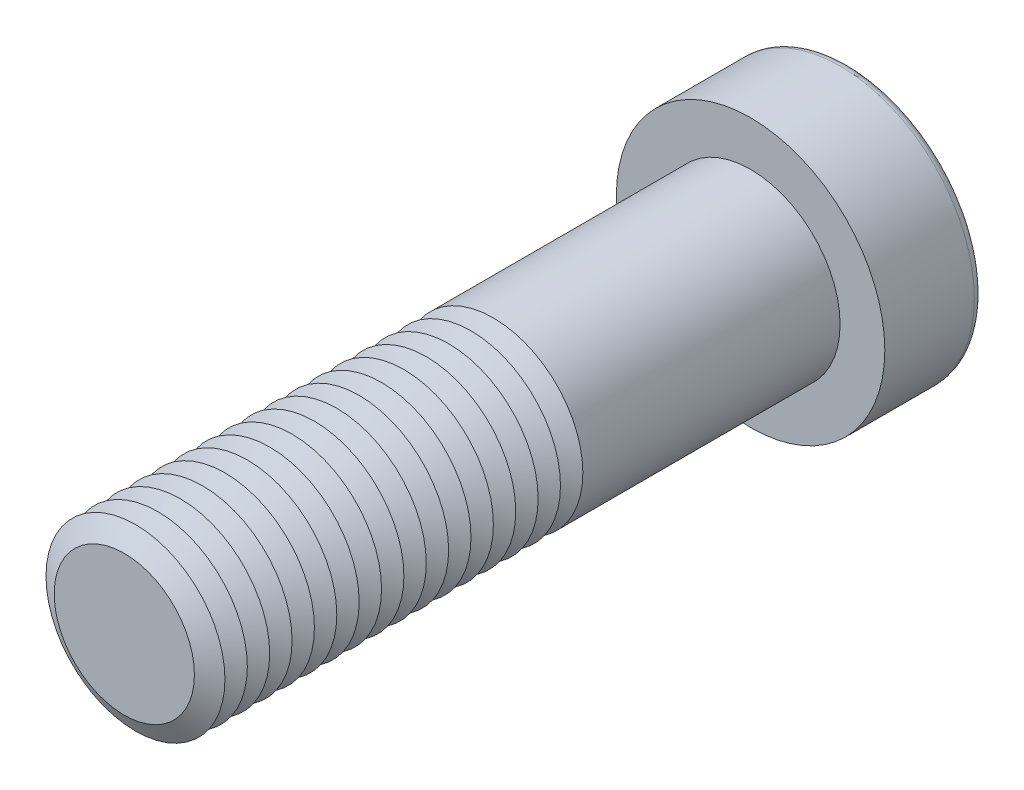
ISO-10303-21;
HEADER;
FILE_DESCRIPTION(('STEP AP214'),'2;1');
FILE_NAME('part.step','',(''),(''),'','','');
FILE_SCHEMA(('AUTOMOTIVE_DESIGN { 1 0 10303 214 1 1 1 1 }'));
ENDSEC;
DATA;
#1=APPLICATION_CONTEXT('core data for automotive mechanical design processes');
#2=APPLICATION_PROTOCOL_DEFINITION('international standard','automotive_design',2000,#1);
#3=PRODUCT_CONTEXT('',#1,'mechanical');
#4=PRODUCT('Part','Part','',(#3));
#5=PRODUCT_RELATED_PRODUCT_CATEGORY('part','',(#4));
#6=PRODUCT_DEFINITION_FORMATION('','',#4);
#7=PRODUCT_DEFINITION_CONTEXT('part definition',#1,'design');
#8=PRODUCT_DEFINITION('design','',#6,#7);
#9=PRODUCT_DEFINITION_SHAPE('','',#8);
#10=(LENGTH_UNIT() NAMED_UNIT(*) SI_UNIT(.MILLI.,.METRE.));
#11=(NAMED_UNIT(*) PLANE_ANGLE_UNIT() SI_UNIT($,.RADIAN.));
#12=(NAMED_UNIT(*) SI_UNIT($,.STERADIAN.) SOLID_ANGLE_UNIT());
#13=UNCERTAINTY_MEASURE_WITH_UNIT(LENGTH_MEASURE(1.E-05),#10,'distance_accuracy_value','');
#14=(GEOMETRIC_REPRESENTATION_CONTEXT(3) GLOBAL_UNCERTAINTY_ASSIGNED_CONTEXT((#13)) GLOBAL_UNIT_ASSIGNED_CONTEXT((#10,
#11,#12)) REPRESENTATION_CONTEXT('',''));
#15=CARTESIAN_POINT('',(0.,0.,0.));
#16=DIRECTION('',(0.,0.,1.));
#17=DIRECTION('',(1.,0.,0.));
#18=AXIS2_PLACEMENT_3D('',#15,#16,#17);
#19=CARTESIAN_POINT('',(0.,0.,61.25));
#20=DIRECTION('',(0.,0.,1.));
#21=DIRECTION('',(1.,0.,0.));
#22=AXIS2_PLACEMENT_3D('',#19,#20,#21);
#23=CONICAL_SURFACE('',#22,10.,1.0471975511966);
#24=CARTESIAN_POINT('',(0.,0.,60.));
#25=DIRECTION('',(0.,0.,1.));
#26=DIRECTION('',(1.,0.,0.));
#27=AXIS2_PLACEMENT_3D('',#24,#25,#26);
#28=CIRCLE('',#27,7.8349364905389);
#29=CARTESIAN_POINT('',(7.8349364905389,0.,60.));
#30=VERTEX_POINT('',#29);
#31=EDGE_CURVE('E313',#30,#30,#28,.T.);
#32=ORIENTED_EDGE('',*,*,#31,.T.);
#33=EDGE_LOOP('',(#32));
#34=FACE_BOUND('',#33,.T.);
#35=CARTESIAN_POINT('',(0.,0.,61.25));
#36=DIRECTION('',(0.,0.,1.));
#37=DIRECTION('',(1.,0.,0.));
#38=AXIS2_PLACEMENT_3D('',#35,#36,#37);
#39=CIRCLE('',#38,10.);
#40=CARTESIAN_POINT('',(10.,0.,61.25));
#41=VERTEX_POINT('',#40);
#42=EDGE_CURVE('E316',#41,#41,#39,.T.);
#43=ORIENTED_EDGE('',*,*,#42,.F.);
#44=EDGE_LOOP('',(#43));
#45=FACE_BOUND('',#44,.T.);
#46=ADVANCED_FACE('F39',(#34,#45),#23,.T.);
#47=CARTESIAN_POINT('',(0.,0.,60.));
#48=DIRECTION('',(0.,0.,-1.));
#49=DIRECTION('',(-1.,0.,0.));
#50=AXIS2_PLACEMENT_3D('',#47,#48,#49);
#51=CONICAL_SURFACE('',#50,7.8349364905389,1.0471975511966);
#52=CARTESIAN_POINT('',(0.,0.,58.75));
#53=DIRECTION('',(0.,0.,1.));
#54=DIRECTION('',(1.,0.,0.));
#55=AXIS2_PLACEMENT_3D('',#52,#53,#54);
#56=CIRCLE('',#55,10.);
#57=CARTESIAN_POINT('',(10.,0.,58.75));
#58=VERTEX_POINT('',#57);
#59=EDGE_CURVE('E323',#58,#58,#56,.T.);
#60=ORIENTED_EDGE('',*,*,#59,.T.);
#61=EDGE_LOOP('',(#60));
#62=FACE_BOUND('',#61,.T.);
#63=ORIENTED_EDGE('',*,*,#31,.F.);
#64=EDGE_LOOP('',(#63));
#65=FACE_BOUND('',#64,.T.);
#66=ADVANCED_FACE('F244',(#62,#65),#51,.T.);
#67=CARTESIAN_POINT('',(0.,0.,70.));
#68=DIRECTION('',(0.,0.,1.));
#69=DIRECTION('',(1.,0.,0.));
#70=AXIS2_PLACEMENT_3D('',#67,#68,#69);
#71=PLANE('',#70);
#72=CARTESIAN_POINT('',(0.,0.,70.));
#73=DIRECTION('',(0.,0.,1.));
#74=DIRECTION('',(1.,0.,0.));
#75=AXIS2_PLACEMENT_3D('',#72,#73,#74);
#76=CIRCLE('',#75,7.8349364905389);
#77=CARTESIAN_POINT('',(7.8349364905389,0.,70.));
#78=VERTEX_POINT('',#77);
#79=EDGE_CURVE('E174',#78,#78,#76,.T.);
#80=ORIENTED_EDGE('',*,*,#79,.T.);
#81=EDGE_LOOP('',(#80));
#82=FACE_BOUND('',#81,.T.);
#83=ADVANCED_FACE('F250',(#82),#71,.T.);
#84=CARTESIAN_POINT('',(0.,0.,70.));
#85=DIRECTION('',(0.,0.,-1.));
#86=DIRECTION('',(-1.,0.,0.));
#87=AXIS2_PLACEMENT_3D('',#84,#85,#86);
#88=CONICAL_SURFACE('',#87,7.8349364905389,1.0471975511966);
#89=CARTESIAN_POINT('',(0.,0.,68.75));
#90=DIRECTION('',(0.,0.,1.));
#91=DIRECTION('',(1.,0.,0.));
#92=AXIS2_PLACEMENT_3D('',#89,#90,#91);
#93=CIRCLE('',#92,10.);
#94=CARTESIAN_POINT('',(10.,0.,68.75));
#95=VERTEX_POINT('',#94);
#96=EDGE_CURVE('E290',#95,#95,#93,.T.);
#97=ORIENTED_EDGE('',*,*,#96,.T.);
#98=EDGE_LOOP('',(#97));
#99=FACE_BOUND('',#98,.T.);
#100=ORIENTED_EDGE('',*,*,#79,.F.);
#101=EDGE_LOOP('',(#100));
#102=FACE_BOUND('',#101,.T.);
#103=ADVANCED_FACE('F198',(#99,#102),#88,.T.);
#104=CARTESIAN_POINT('',(0.,0.,68.75));
#105=DIRECTION('',(0.,0.,1.));
#106=DIRECTION('',(1.,0.,0.));
#107=AXIS2_PLACEMENT_3D('',#104,#105,#106);
#108=CONICAL_SURFACE('',#107,10.,1.0471975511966);
#109=CARTESIAN_POINT('',(0.,0.,67.5));
#110=DIRECTION('',(0.,0.,1.));
#111=DIRECTION('',(1.,0.,0.));
#112=AXIS2_PLACEMENT_3D('',#109,#110,#111);
#113=CIRCLE('',#112,7.8349364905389);
#114=CARTESIAN_POINT('',(7.8349364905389,0.,67.5));
#115=VERTEX_POINT('',#114);
#116=EDGE_CURVE('E287',#115,#115,#113,.T.);
#117=ORIENTED_EDGE('',*,*,#116,.T.);
#118=EDGE_LOOP('',(#117));
#119=FACE_BOUND('',#118,.T.);
#120=ORIENTED_EDGE('',*,*,#96,.F.);
#121=EDGE_LOOP('',(#120));
#122=FACE_BOUND('',#121,.T.);
#123=ADVANCED_FACE('F276',(#119,#122),#108,.T.);
#124=CARTESIAN_POINT('',(0.,0.,67.5));
#125=DIRECTION('',(0.,0.,-1.));
#126=DIRECTION('',(-1.,0.,0.));
#127=AXIS2_PLACEMENT_3D('',#124,#125,#126);
#128=CONICAL_SURFACE('',#127,7.8349364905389,1.0471975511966);
#129=CARTESIAN_POINT('',(0.,0.,66.25));
#130=DIRECTION('',(0.,0.,1.));
#131=DIRECTION('',(1.,0.,0.));
#132=AXIS2_PLACEMENT_3D('',#129,#130,#131);
#133=CIRCLE('',#132,10.);
#134=CARTESIAN_POINT('',(10.,0.,66.25));
#135=VERTEX_POINT('',#134);
#136=EDGE_CURVE('E299',#135,#135,#133,.T.);
#137=ORIENTED_EDGE('',*,*,#136,.T.);
#138=EDGE_LOOP('',(#137));
#139=FACE_BOUND('',#138,.T.);
#140=ORIENTED_EDGE('',*,*,#116,.F.);
#141=EDGE_LOOP('',(#140));
#142=FACE_BOUND('',#141,.T.);
#143=ADVANCED_FACE('F273',(#139,#142),#128,.T.);
#144=CARTESIAN_POINT('',(0.,0.,66.25));
#145=DIRECTION('',(0.,0.,1.));
#146=DIRECTION('',(1.,0.,0.));
#147=AXIS2_PLACEMENT_3D('',#144,#145,#146);
#148=CONICAL_SURFACE('',#147,10.,1.0471975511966);
#149=CARTESIAN_POINT('',(0.,0.,65.));
#150=DIRECTION('',(0.,0.,1.));
#151=DIRECTION('',(1.,0.,0.));
#152=AXIS2_PLACEMENT_3D('',#149,#150,#151);
#153=CIRCLE('',#152,7.8349364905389);
#154=CARTESIAN_POINT('',(7.8349364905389,0.,65.));
#155=VERTEX_POINT('',#154);
#156=EDGE_CURVE('E292',#155,#155,#153,.T.);
#157=ORIENTED_EDGE('',*,*,#156,.T.);
#158=EDGE_LOOP('',(#157));
#159=FACE_BOUND('',#158,.T.);
#160=ORIENTED_EDGE('',*,*,#136,.F.);
#161=EDGE_LOOP('',(#160));
#162=FACE_BOUND('',#161,.T.);
#163=ADVANCED_FACE('F269',(#159,#162),#148,.T.);
#164=CARTESIAN_POINT('',(0.,0.,65.));
#165=DIRECTION('',(0.,0.,-1.));
#166=DIRECTION('',(-1.,0.,0.));
#167=AXIS2_PLACEMENT_3D('',#164,#165,#166);
#168=CONICAL_SURFACE('',#167,7.8349364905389,1.0471975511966);
#169=CARTESIAN_POINT('',(0.,0.,63.75));
#170=DIRECTION('',(0.,0.,1.));
#171=DIRECTION('',(1.,0.,0.));
#172=AXIS2_PLACEMENT_3D('',#169,#170,#171);
#173=CIRCLE('',#172,10.);
#174=CARTESIAN_POINT('',(10.,0.,63.75));
#175=VERTEX_POINT('',#174);
#176=EDGE_CURVE('E309',#175,#175,#173,.T.);
#177=ORIENTED_EDGE('',*,*,#176,.T.);
#178=EDGE_LOOP('',(#177));
#179=FACE_BOUND('',#178,.T.);
#180=ORIENTED_EDGE('',*,*,#156,.F.);
#181=EDGE_LOOP('',(#180));
#182=FACE_BOUND('',#181,.T.);
#183=ADVANCED_FACE('F265',(#179,#182),#168,.T.);
#184=CARTESIAN_POINT('',(0.,0.,63.75));
#185=DIRECTION('',(0.,0.,1.));
#186=DIRECTION('',(1.,0.,0.));
#187=AXIS2_PLACEMENT_3D('',#184,#185,#186);
#188=CONICAL_SURFACE('',#187,10.,1.0471975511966);
#189=CARTESIAN_POINT('',(0.,0.,62.5));
#190=DIRECTION('',(0.,0.,1.));
#191=DIRECTION('',(1.,0.,0.));
#192=AXIS2_PLACEMENT_3D('',#189,#190,#191);
#193=CIRCLE('',#192,7.8349364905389);
#194=CARTESIAN_POINT('',(7.8349364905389,0.,62.5));
#195=VERTEX_POINT('',#194);
#196=EDGE_CURVE('E305',#195,#195,#193,.T.);
#197=ORIENTED_EDGE('',*,*,#196,.T.);
#198=EDGE_LOOP('',(#197));
#199=FACE_BOUND('',#198,.T.);
#200=ORIENTED_EDGE('',*,*,#176,.F.);
#201=EDGE_LOOP('',(#200));
#202=FACE_BOUND('',#201,.T.);
#203=ADVANCED_FACE('F261',(#199,#202),#188,.T.);
#204=CARTESIAN_POINT('',(0.,0.,62.5));
#205=DIRECTION('',(0.,0.,-1.));
#206=DIRECTION('',(-1.,0.,0.));
#207=AXIS2_PLACEMENT_3D('',#204,#205,#206);
#208=CONICAL_SURFACE('',#207,7.8349364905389,1.0471975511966);
#209=ORIENTED_EDGE('',*,*,#42,.T.);
#210=EDGE_LOOP('',(#209));
#211=FACE_BOUND('',#210,.T.);
#212=ORIENTED_EDGE('',*,*,#196,.F.);
#213=EDGE_LOOP('',(#212));
#214=FACE_BOUND('',#213,.T.);
#215=ADVANCED_FACE('F257',(#211,#214),#208,.T.);
#216=CARTESIAN_POINT('',(0.,0.,58.75));
#217=DIRECTION('',(0.,0.,1.));
#218=DIRECTION('',(1.,0.,0.));
#219=AXIS2_PLACEMENT_3D('',#216,#217,#218);
#220=CONICAL_SURFACE('',#219,10.,1.0471975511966);
#221=CARTESIAN_POINT('',(0.,0.,57.5));
#222=DIRECTION('',(0.,0.,1.));
#223=DIRECTION('',(1.,0.,0.));
#224=AXIS2_PLACEMENT_3D('',#221,#222,#223);
#225=CIRCLE('',#224,7.8349364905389);
#226=CARTESIAN_POINT('',(7.8349364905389,0.,57.5));
#227=VERTEX_POINT('',#226);
#228=EDGE_CURVE('E319',#227,#227,#225,.T.);
#229=ORIENTED_EDGE('',*,*,#228,.T.);
#230=EDGE_LOOP('',(#229));
#231=FACE_BOUND('',#230,.T.);
#232=ORIENTED_EDGE('',*,*,#59,.F.);
#233=EDGE_LOOP('',(#232));
#234=FACE_BOUND('',#233,.T.);
#235=ADVANCED_FACE('F260',(#231,#234),#220,.T.);
#236=CARTESIAN_POINT('',(0.,0.,57.5));
#237=DIRECTION('',(0.,0.,-1.));
#238=DIRECTION('',(-1.,0.,0.));
#239=AXIS2_PLACEMENT_3D('',#236,#237,#238);
#240=CONICAL_SURFACE('',#239,7.8349364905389,1.0471975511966);
#241=CARTESIAN_POINT('',(0.,0.,56.25));
#242=DIRECTION('',(0.,0.,1.));
#243=DIRECTION('',(1.,0.,0.));
#244=AXIS2_PLACEMENT_3D('',#241,#242,#243);
#245=CIRCLE('',#244,10.);
#246=CARTESIAN_POINT('',(10.,0.,56.25));
#247=VERTEX_POINT('',#246);
#248=EDGE_CURVE('E330',#247,#247,#245,.T.);
#249=ORIENTED_EDGE('',*,*,#248,.T.);
#250=EDGE_LOOP('',(#249));
#251=FACE_BOUND('',#250,.T.);
#252=ORIENTED_EDGE('',*,*,#228,.F.);
#253=EDGE_LOOP('',(#252));
#254=FACE_BOUND('',#253,.T.);
#255=ADVANCED_FACE('F511',(#251,#254),#240,.T.);
#256=CARTESIAN_POINT('',(0.,0.,56.25));
#257=DIRECTION('',(0.,0.,1.));
#258=DIRECTION('',(1.,0.,0.));
#259=AXIS2_PLACEMENT_3D('',#256,#257,#258);
#260=CONICAL_SURFACE('',#259,10.,1.0471975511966);
#261=CARTESIAN_POINT('',(0.,0.,55.));
#262=DIRECTION('',(0.,0.,1.));
#263=DIRECTION('',(1.,0.,0.));
#264=AXIS2_PLACEMENT_3D('',#261,#262,#263);
#265=CIRCLE('',#264,7.8349364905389);
#266=CARTESIAN_POINT('',(7.8349364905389,0.,55.));
#267=VERTEX_POINT('',#266);
#268=EDGE_CURVE('E326',#267,#267,#265,.T.);
#269=ORIENTED_EDGE('',*,*,#268,.T.);
#270=EDGE_LOOP('',(#269));
#271=FACE_BOUND('',#270,.T.);
#272=ORIENTED_EDGE('',*,*,#248,.F.);
#273=EDGE_LOOP('',(#272));
#274=FACE_BOUND('',#273,.T.);
#275=ADVANCED_FACE('F507',(#271,#274),#260,.T.);
#276=CARTESIAN_POINT('',(0.,0.,55.));
#277=DIRECTION('',(0.,0.,-1.));
#278=DIRECTION('',(-1.,0.,0.));
#279=AXIS2_PLACEMENT_3D('',#276,#277,#278);
#280=CONICAL_SURFACE('',#279,7.8349364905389,1.0471975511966);
#281=CARTESIAN_POINT('',(0.,0.,53.75));
#282=DIRECTION('',(0.,0.,1.));
#283=DIRECTION('',(1.,0.,0.));
#284=AXIS2_PLACEMENT_3D('',#281,#282,#283);
#285=CIRCLE('',#284,10.);
#286=CARTESIAN_POINT('',(10.,0.,53.75));
#287=VERTEX_POINT('',#286);
#288=EDGE_CURVE('E338',#287,#287,#285,.T.);
#289=ORIENTED_EDGE('',*,*,#288,.T.);
#290=EDGE_LOOP('',(#289));
#291=FACE_BOUND('',#290,.T.);
#292=ORIENTED_EDGE('',*,*,#268,.F.);
#293=EDGE_LOOP('',(#292));
#294=FACE_BOUND('',#293,.T.);
#295=ADVANCED_FACE('F503',(#291,#294),#280,.T.);
#296=CARTESIAN_POINT('',(0.,0.,53.75));
#297=DIRECTION('',(0.,0.,1.));
#298=DIRECTION('',(1.,0.,0.));
#299=AXIS2_PLACEMENT_3D('',#296,#297,#298);
#300=CONICAL_SURFACE('',#299,10.,1.0471975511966);
#301=CARTESIAN_POINT('',(0.,0.,52.5));
#302=DIRECTION('',(0.,0.,1.));
#303=DIRECTION('',(1.,0.,0.));
#304=AXIS2_PLACEMENT_3D('',#301,#302,#303);
#305=CIRCLE('',#304,7.8349364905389);
#306=CARTESIAN_POINT('',(7.8349364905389,0.,52.5));
#307=VERTEX_POINT('',#306);
#308=EDGE_CURVE('E334',#307,#307,#305,.T.);
#309=ORIENTED_EDGE('',*,*,#308,.T.);
#310=EDGE_LOOP('',(#309));
#311=FACE_BOUND('',#310,.T.);
#312=ORIENTED_EDGE('',*,*,#288,.F.);
#313=EDGE_LOOP('',(#312));
#314=FACE_BOUND('',#313,.T.);
#315=ADVANCED_FACE('F499',(#311,#314),#300,.T.);
#316=CARTESIAN_POINT('',(0.,0.,52.5));
#317=DIRECTION('',(0.,0.,-1.));
#318=DIRECTION('',(-1.,0.,0.));
#319=AXIS2_PLACEMENT_3D('',#316,#317,#318);
#320=CONICAL_SURFACE('',#319,7.8349364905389,1.0471975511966);
#321=CARTESIAN_POINT('',(0.,0.,51.25));
#322=DIRECTION('',(0.,0.,1.));
#323=DIRECTION('',(1.,0.,0.));
#324=AXIS2_PLACEMENT_3D('',#321,#322,#323);
#325=CIRCLE('',#324,10.);
#326=CARTESIAN_POINT('',(10.,0.,51.25));
#327=VERTEX_POINT('',#326);
#328=EDGE_CURVE('E346',#327,#327,#325,.T.);
#329=ORIENTED_EDGE('',*,*,#328,.T.);
#330=EDGE_LOOP('',(#329));
#331=FACE_BOUND('',#330,.T.);
#332=ORIENTED_EDGE('',*,*,#308,.F.);
#333=EDGE_LOOP('',(#332));
#334=FACE_BOUND('',#333,.T.);
#335=ADVANCED_FACE('F495',(#331,#334),#320,.T.);
#336=CARTESIAN_POINT('',(0.,0.,51.25));
#337=DIRECTION('',(0.,0.,1.));
#338=DIRECTION('',(1.,0.,0.));
#339=AXIS2_PLACEMENT_3D('',#336,#337,#338);
#340=CONICAL_SURFACE('',#339,10.,1.0471975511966);
#341=CARTESIAN_POINT('',(0.,0.,50.));
#342=DIRECTION('',(0.,0.,1.));
#343=DIRECTION('',(1.,0.,0.));
#344=AXIS2_PLACEMENT_3D('',#341,#342,#343);
#345=CIRCLE('',#344,7.8349364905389);
#346=CARTESIAN_POINT('',(7.8349364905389,0.,50.));
#347=VERTEX_POINT('',#346);
#348=EDGE_CURVE('E342',#347,#347,#345,.T.);
#349=ORIENTED_EDGE('',*,*,#348,.T.);
#350=EDGE_LOOP('',(#349));
#351=FACE_BOUND('',#350,.T.);
#352=ORIENTED_EDGE('',*,*,#328,.F.);
#353=EDGE_LOOP('',(#352));
#354=FACE_BOUND('',#353,.T.);
#355=ADVANCED_FACE('F491',(#351,#354),#340,.T.);
#356=CARTESIAN_POINT('',(0.,0.,50.));
#357=DIRECTION('',(0.,0.,-1.));
#358=DIRECTION('',(-1.,0.,0.));
#359=AXIS2_PLACEMENT_3D('',#356,#357,#358);
#360=CONICAL_SURFACE('',#359,7.8349364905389,1.0471975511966);
#361=CARTESIAN_POINT('',(0.,0.,48.75));
#362=DIRECTION('',(0.,0.,1.));
#363=DIRECTION('',(1.,0.,0.));
#364=AXIS2_PLACEMENT_3D('',#361,#362,#363);
#365=CIRCLE('',#364,10.);
#366=CARTESIAN_POINT('',(10.,0.,48.75));
#367=VERTEX_POINT('',#366);
#368=EDGE_CURVE('E354',#367,#367,#365,.T.);
#369=ORIENTED_EDGE('',*,*,#368,.T.);
#370=EDGE_LOOP('',(#369));
#371=FACE_BOUND('',#370,.T.);
#372=ORIENTED_EDGE('',*,*,#348,.F.);
#373=EDGE_LOOP('',(#372));
#374=FACE_BOUND('',#373,.T.);
#375=ADVANCED_FACE('F487',(#371,#374),#360,.T.);
#376=CARTESIAN_POINT('',(0.,0.,48.75));
#377=DIRECTION('',(0.,0.,1.));
#378=DIRECTION('',(1.,0.,0.));
#379=AXIS2_PLACEMENT_3D('',#376,#377,#378);
#380=CONICAL_SURFACE('',#379,10.,1.0471975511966);
#381=CARTESIAN_POINT('',(0.,0.,47.5));
#382=DIRECTION('',(0.,0.,1.));
#383=DIRECTION('',(1.,0.,0.));
#384=AXIS2_PLACEMENT_3D('',#381,#382,#383);
#385=CIRCLE('',#384,7.8349364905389);
#386=CARTESIAN_POINT('',(7.8349364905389,0.,47.5));
#387=VERTEX_POINT('',#386);
#388=EDGE_CURVE('E350',#387,#387,#385,.T.);
#389=ORIENTED_EDGE('',*,*,#388,.T.);
#390=EDGE_LOOP('',(#389));
#391=FACE_BOUND('',#390,.T.);
#392=ORIENTED_EDGE('',*,*,#368,.F.);
#393=EDGE_LOOP('',(#392));
#394=FACE_BOUND('',#393,.T.);
#395=ADVANCED_FACE('F483',(#391,#394),#380,.T.);
#396=CARTESIAN_POINT('',(0.,0.,47.5));
#397=DIRECTION('',(0.,0.,-1.));
#398=DIRECTION('',(-1.,0.,0.));
#399=AXIS2_PLACEMENT_3D('',#396,#397,#398);
#400=CONICAL_SURFACE('',#399,7.8349364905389,1.0471975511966);
#401=CARTESIAN_POINT('',(0.,0.,46.25));
#402=DIRECTION('',(0.,0.,1.));
#403=DIRECTION('',(1.,0.,0.));
#404=AXIS2_PLACEMENT_3D('',#401,#402,#403);
#405=CIRCLE('',#404,10.);
#406=CARTESIAN_POINT('',(10.,0.,46.25));
#407=VERTEX_POINT('',#406);
#408=EDGE_CURVE('E362',#407,#407,#405,.T.);
#409=ORIENTED_EDGE('',*,*,#408,.T.);
#410=EDGE_LOOP('',(#409));
#411=FACE_BOUND('',#410,.T.);
#412=ORIENTED_EDGE('',*,*,#388,.F.);
#413=EDGE_LOOP('',(#412));
#414=FACE_BOUND('',#413,.T.);
#415=ADVANCED_FACE('F479',(#411,#414),#400,.T.);
#416=CARTESIAN_POINT('',(0.,0.,46.25));
#417=DIRECTION('',(0.,0.,1.));
#418=DIRECTION('',(1.,0.,0.));
#419=AXIS2_PLACEMENT_3D('',#416,#417,#418);
#420=CONICAL_SURFACE('',#419,10.,1.0471975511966);
#421=CARTESIAN_POINT('',(0.,0.,45.));
#422=DIRECTION('',(0.,0.,1.));
#423=DIRECTION('',(1.,0.,0.));
#424=AXIS2_PLACEMENT_3D('',#421,#422,#423);
#425=CIRCLE('',#424,7.8349364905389);
#426=CARTESIAN_POINT('',(7.8349364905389,0.,45.));
#427=VERTEX_POINT('',#426);
#428=EDGE_CURVE('E358',#427,#427,#425,.T.);
#429=ORIENTED_EDGE('',*,*,#428,.T.);
#430=EDGE_LOOP('',(#429));
#431=FACE_BOUND('',#430,.T.);
#432=ORIENTED_EDGE('',*,*,#408,.F.);
#433=EDGE_LOOP('',(#432));
#434=FACE_BOUND('',#433,.T.);
#435=ADVANCED_FACE('F475',(#431,#434),#420,.T.);
#436=CARTESIAN_POINT('',(0.,0.,45.));
#437=DIRECTION('',(0.,0.,-1.));
#438=DIRECTION('',(-1.,0.,0.));
#439=AXIS2_PLACEMENT_3D('',#436,#437,#438);
#440=CONICAL_SURFACE('',#439,7.8349364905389,1.0471975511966);
#441=CARTESIAN_POINT('',(0.,0.,43.75));
#442=DIRECTION('',(0.,0.,1.));
#443=DIRECTION('',(1.,0.,0.));
#444=AXIS2_PLACEMENT_3D('',#441,#442,#443);
#445=CIRCLE('',#444,10.);
#446=CARTESIAN_POINT('',(10.,0.,43.75));
#447=VERTEX_POINT('',#446);
#448=EDGE_CURVE('E370',#447,#447,#445,.T.);
#449=ORIENTED_EDGE('',*,*,#448,.T.);
#450=EDGE_LOOP('',(#449));
#451=FACE_BOUND('',#450,.T.);
#452=ORIENTED_EDGE('',*,*,#428,.F.);
#453=EDGE_LOOP('',(#452));
#454=FACE_BOUND('',#453,.T.);
#455=ADVANCED_FACE('F471',(#451,#454),#440,.T.);
#456=CARTESIAN_POINT('',(0.,0.,43.75));
#457=DIRECTION('',(0.,0.,1.));
#458=DIRECTION('',(1.,0.,0.));
#459=AXIS2_PLACEMENT_3D('',#456,#457,#458);
#460=CONICAL_SURFACE('',#459,10.,1.0471975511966);
#461=CARTESIAN_POINT('',(0.,0.,42.5));
#462=DIRECTION('',(0.,0.,1.));
#463=DIRECTION('',(1.,0.,0.));
#464=AXIS2_PLACEMENT_3D('',#461,#462,#463);
#465=CIRCLE('',#464,7.8349364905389);
#466=CARTESIAN_POINT('',(7.8349364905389,0.,42.5));
#467=VERTEX_POINT('',#466);
#468=EDGE_CURVE('E366',#467,#467,#465,.T.);
#469=ORIENTED_EDGE('',*,*,#468,.T.);
#470=EDGE_LOOP('',(#469));
#471=FACE_BOUND('',#470,.T.);
#472=ORIENTED_EDGE('',*,*,#448,.F.);
#473=EDGE_LOOP('',(#472));
#474=FACE_BOUND('',#473,.T.);
#475=ADVANCED_FACE('F467',(#471,#474),#460,.T.);
#476=CARTESIAN_POINT('',(0.,0.,42.5));
#477=DIRECTION('',(0.,0.,-1.));
#478=DIRECTION('',(-1.,0.,0.));
#479=AXIS2_PLACEMENT_3D('',#476,#477,#478);
#480=CONICAL_SURFACE('',#479,7.8349364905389,1.0471975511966);
#481=CARTESIAN_POINT('',(0.,0.,41.25));
#482=DIRECTION('',(0.,0.,1.));
#483=DIRECTION('',(1.,0.,0.));
#484=AXIS2_PLACEMENT_3D('',#481,#482,#483);
#485=CIRCLE('',#484,10.);
#486=CARTESIAN_POINT('',(10.,0.,41.25));
#487=VERTEX_POINT('',#486);
#488=EDGE_CURVE('E378',#487,#487,#485,.T.);
#489=ORIENTED_EDGE('',*,*,#488,.T.);
#490=EDGE_LOOP('',(#489));
#491=FACE_BOUND('',#490,.T.);
#492=ORIENTED_EDGE('',*,*,#468,.F.);
#493=EDGE_LOOP('',(#492));
#494=FACE_BOUND('',#493,.T.);
#495=ADVANCED_FACE('F463',(#491,#494),#480,.T.);
#496=CARTESIAN_POINT('',(0.,0.,41.25));
#497=DIRECTION('',(0.,0.,1.));
#498=DIRECTION('',(1.,0.,0.));
#499=AXIS2_PLACEMENT_3D('',#496,#497,#498);
#500=CONICAL_SURFACE('',#499,10.,1.0471975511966);
#501=CARTESIAN_POINT('',(0.,0.,40.));
#502=DIRECTION('',(0.,0.,1.));
#503=DIRECTION('',(1.,0.,0.));
#504=AXIS2_PLACEMENT_3D('',#501,#502,#503);
#505=CIRCLE('',#504,7.8349364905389);
#506=CARTESIAN_POINT('',(7.8349364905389,0.,40.));
#507=VERTEX_POINT('',#506);
#508=EDGE_CURVE('E374',#507,#507,#505,.T.);
#509=ORIENTED_EDGE('',*,*,#508,.T.);
#510=EDGE_LOOP('',(#509));
#511=FACE_BOUND('',#510,.T.);
#512=ORIENTED_EDGE('',*,*,#488,.F.);
#513=EDGE_LOOP('',(#512));
#514=FACE_BOUND('',#513,.T.);
#515=ADVANCED_FACE('F459',(#511,#514),#500,.T.);
#516=CARTESIAN_POINT('',(0.,0.,40.));
#517=DIRECTION('',(0.,0.,-1.));
#518=DIRECTION('',(-1.,0.,0.));
#519=AXIS2_PLACEMENT_3D('',#516,#517,#518);
#520=CONICAL_SURFACE('',#519,7.8349364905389,1.0471975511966);
#521=CARTESIAN_POINT('',(0.,0.,38.75));
#522=DIRECTION('',(0.,0.,1.));
#523=DIRECTION('',(1.,0.,0.));
#524=AXIS2_PLACEMENT_3D('',#521,#522,#523);
#525=CIRCLE('',#524,10.);
#526=CARTESIAN_POINT('',(10.,0.,38.75));
#527=VERTEX_POINT('',#526);
#528=EDGE_CURVE('E386',#527,#527,#525,.T.);
#529=ORIENTED_EDGE('',*,*,#528,.T.);
#530=EDGE_LOOP('',(#529));
#531=FACE_BOUND('',#530,.T.);
#532=ORIENTED_EDGE('',*,*,#508,.F.);
#533=EDGE_LOOP('',(#532));
#534=FACE_BOUND('',#533,.T.);
#535=ADVANCED_FACE('F455',(#531,#534),#520,.T.);
#536=CARTESIAN_POINT('',(0.,0.,38.75));
#537=DIRECTION('',(0.,0.,1.));
#538=DIRECTION('',(1.,0.,0.));
#539=AXIS2_PLACEMENT_3D('',#536,#537,#538);
#540=CONICAL_SURFACE('',#539,10.,1.0471975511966);
#541=CARTESIAN_POINT('',(0.,0.,37.5));
#542=DIRECTION('',(0.,0.,1.));
#543=DIRECTION('',(1.,0.,0.));
#544=AXIS2_PLACEMENT_3D('',#541,#542,#543);
#545=CIRCLE('',#544,7.8349364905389);
#546=CARTESIAN_POINT('',(7.8349364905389,0.,37.5));
#547=VERTEX_POINT('',#546);
#548=EDGE_CURVE('E382',#547,#547,#545,.T.);
#549=ORIENTED_EDGE('',*,*,#548,.T.);
#550=EDGE_LOOP('',(#549));
#551=FACE_BOUND('',#550,.T.);
#552=ORIENTED_EDGE('',*,*,#528,.F.);
#553=EDGE_LOOP('',(#552));
#554=FACE_BOUND('',#553,.T.);
#555=ADVANCED_FACE('F451',(#551,#554),#540,.T.);
#556=CARTESIAN_POINT('',(0.,0.,37.5));
#557=DIRECTION('',(0.,0.,-1.));
#558=DIRECTION('',(-1.,0.,0.));
#559=AXIS2_PLACEMENT_3D('',#556,#557,#558);
#560=CONICAL_SURFACE('',#559,7.8349364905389,1.0471975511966);
#561=CARTESIAN_POINT('',(0.,0.,36.25));
#562=DIRECTION('',(0.,0.,1.));
#563=DIRECTION('',(1.,0.,0.));
#564=AXIS2_PLACEMENT_3D('',#561,#562,#563);
#565=CIRCLE('',#564,10.);
#566=CARTESIAN_POINT('',(10.,0.,36.25));
#567=VERTEX_POINT('',#566);
#568=EDGE_CURVE('E394',#567,#567,#565,.T.);
#569=ORIENTED_EDGE('',*,*,#568,.T.);
#570=EDGE_LOOP('',(#569));
#571=FACE_BOUND('',#570,.T.);
#572=ORIENTED_EDGE('',*,*,#548,.F.);
#573=EDGE_LOOP('',(#572));
#574=FACE_BOUND('',#573,.T.);
#575=ADVANCED_FACE('F447',(#571,#574),#560,.T.);
#576=CARTESIAN_POINT('',(0.,0.,36.25));
#577=DIRECTION('',(0.,0.,1.));
#578=DIRECTION('',(1.,0.,0.));
#579=AXIS2_PLACEMENT_3D('',#576,#577,#578);
#580=CONICAL_SURFACE('',#579,10.,1.0471975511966);
#581=CARTESIAN_POINT('',(0.,0.,35.));
#582=DIRECTION('',(0.,0.,1.));
#583=DIRECTION('',(1.,0.,0.));
#584=AXIS2_PLACEMENT_3D('',#581,#582,#583);
#585=CIRCLE('',#584,7.8349364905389);
#586=CARTESIAN_POINT('',(7.8349364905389,0.,35.));
#587=VERTEX_POINT('',#586);
#588=EDGE_CURVE('E390',#587,#587,#585,.T.);
#589=ORIENTED_EDGE('',*,*,#588,.T.);
#590=EDGE_LOOP('',(#589));
#591=FACE_BOUND('',#590,.T.);
#592=ORIENTED_EDGE('',*,*,#568,.F.);
#593=EDGE_LOOP('',(#592));
#594=FACE_BOUND('',#593,.T.);
#595=ADVANCED_FACE('F443',(#591,#594),#580,.T.);
#596=CARTESIAN_POINT('',(0.,0.,35.));
#597=DIRECTION('',(0.,0.,-1.));
#598=DIRECTION('',(-1.,0.,0.));
#599=AXIS2_PLACEMENT_3D('',#596,#597,#598);
#600=CONICAL_SURFACE('',#599,7.8349364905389,1.0471975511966);
#601=CARTESIAN_POINT('',(0.,0.,33.75));
#602=DIRECTION('',(0.,0.,1.));
#603=DIRECTION('',(1.,0.,0.));
#604=AXIS2_PLACEMENT_3D('',#601,#602,#603);
#605=CIRCLE('',#604,10.);
#606=CARTESIAN_POINT('',(10.,0.,33.75));
#607=VERTEX_POINT('',#606);
#608=EDGE_CURVE('E402',#607,#607,#605,.T.);
#609=ORIENTED_EDGE('',*,*,#608,.T.);
#610=EDGE_LOOP('',(#609));
#611=FACE_BOUND('',#610,.T.);
#612=ORIENTED_EDGE('',*,*,#588,.F.);
#613=EDGE_LOOP('',(#612));
#614=FACE_BOUND('',#613,.T.);
#615=ADVANCED_FACE('F439',(#611,#614),#600,.T.);
#616=CARTESIAN_POINT('',(0.,0.,33.75));
#617=DIRECTION('',(0.,0.,1.));
#618=DIRECTION('',(1.,0.,0.));
#619=AXIS2_PLACEMENT_3D('',#616,#617,#618);
#620=CONICAL_SURFACE('',#619,10.,1.0471975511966);
#621=CARTESIAN_POINT('',(0.,0.,32.5));
#622=DIRECTION('',(0.,0.,1.));
#623=DIRECTION('',(1.,0.,0.));
#624=AXIS2_PLACEMENT_3D('',#621,#622,#623);
#625=CIRCLE('',#624,7.8349364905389);
#626=CARTESIAN_POINT('',(7.8349364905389,0.,32.5));
#627=VERTEX_POINT('',#626);
#628=EDGE_CURVE('E398',#627,#627,#625,.T.);
#629=ORIENTED_EDGE('',*,*,#628,.T.);
#630=EDGE_LOOP('',(#629));
#631=FACE_BOUND('',#630,.T.);
#632=ORIENTED_EDGE('',*,*,#608,.F.);
#633=EDGE_LOOP('',(#632));
#634=FACE_BOUND('',#633,.T.);
#635=ADVANCED_FACE('F434',(#631,#634),#620,.T.);
#636=CARTESIAN_POINT('',(0.,0.,32.5));
#637=DIRECTION('',(0.,0.,-1.));
#638=DIRECTION('',(-1.,0.,0.));
#639=AXIS2_PLACEMENT_3D('',#636,#637,#638);
#640=CONICAL_SURFACE('',#639,7.8349364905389,1.0471975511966);
#641=CARTESIAN_POINT('',(0.,0.,31.25));
#642=DIRECTION('',(0.,0.,1.));
#643=DIRECTION('',(1.,0.,0.));
#644=AXIS2_PLACEMENT_3D('',#641,#642,#643);
#645=CIRCLE('',#644,10.);
#646=CARTESIAN_POINT('',(10.,0.,31.25));
#647=VERTEX_POINT('',#646);
#648=EDGE_CURVE('E414',#647,#647,#645,.T.);
#649=ORIENTED_EDGE('',*,*,#648,.T.);
#650=EDGE_LOOP('',(#649));
#651=FACE_BOUND('',#650,.T.);
#652=ORIENTED_EDGE('',*,*,#628,.F.);
#653=EDGE_LOOP('',(#652));
#654=FACE_BOUND('',#653,.T.);
#655=ADVANCED_FACE('F420',(#651,#654),#640,.T.);
#656=CARTESIAN_POINT('',(0.,0.,31.25));
#657=DIRECTION('',(0.,0.,1.));
#658=DIRECTION('',(1.,0.,0.));
#659=AXIS2_PLACEMENT_3D('',#656,#657,#658);
#660=CONICAL_SURFACE('',#659,10.,1.0471975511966);
#661=CARTESIAN_POINT('',(0.,0.,30.));
#662=DIRECTION('',(0.,0.,1.));
#663=DIRECTION('',(1.,0.,0.));
#664=AXIS2_PLACEMENT_3D('',#661,#662,#663);
#665=CIRCLE('',#664,7.8349364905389);
#666=CARTESIAN_POINT('',(7.8349364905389,0.,30.));
#667=VERTEX_POINT('',#666);
#668=EDGE_CURVE('E406',#667,#667,#665,.T.);
#669=ORIENTED_EDGE('',*,*,#668,.T.);
#670=EDGE_LOOP('',(#669));
#671=FACE_BOUND('',#670,.T.);
#672=ORIENTED_EDGE('',*,*,#648,.F.);
#673=EDGE_LOOP('',(#672));
#674=FACE_BOUND('',#673,.T.);
#675=ADVANCED_FACE('F423',(#671,#674),#660,.T.);
#676=CARTESIAN_POINT('',(0.,0.,30.));
#677=DIRECTION('',(0.,0.,-1.));
#678=DIRECTION('',(-1.,0.,0.));
#679=AXIS2_PLACEMENT_3D('',#676,#677,#678);
#680=CONICAL_SURFACE('',#679,7.8349364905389,1.0471975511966);
#681=CARTESIAN_POINT('',(0.,0.,28.75));
#682=DIRECTION('',(0.,0.,1.));
#683=DIRECTION('',(1.,0.,0.));
#684=AXIS2_PLACEMENT_3D('',#681,#682,#683);
#685=CIRCLE('',#684,10.);
#686=CARTESIAN_POINT('',(10.,0.,28.75));
#687=VERTEX_POINT('',#686);
#688=EDGE_CURVE('E410',#687,#687,#685,.T.);
#689=ORIENTED_EDGE('',*,*,#688,.T.);
#690=EDGE_LOOP('',(#689));
#691=FACE_BOUND('',#690,.T.);
#692=ORIENTED_EDGE('',*,*,#668,.F.);
#693=EDGE_LOOP('',(#692));
#694=FACE_BOUND('',#693,.T.);
#695=ADVANCED_FACE('F425',(#691,#694),#680,.T.);
#696=CARTESIAN_POINT('',(0.,0.,-0.499999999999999));
#697=DIRECTION('',(0.,0.,-1.));
#698=DIRECTION('',(-1.,0.,0.));
#699=AXIS2_PLACEMENT_3D('',#696,#697,#698);
#700=CONICAL_SURFACE('',#699,7.,1.0471975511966);
#701=CARTESIAN_POINT('',(0.,0.,3.54145188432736));
#702=VERTEX_POINT('',#701);
#703=VERTEX_LOOP('',#702);
#704=FACE_BOUND('',#703,.T.);
#705=CARTESIAN_POINT('',(0.,0.,-0.499999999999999));
#706=DIRECTION('',(0.,0.,-1.));
#707=DIRECTION('',(-1.,0.,0.));
#708=AXIS2_PLACEMENT_3D('',#705,#706,#707);
#709=CIRCLE('',#708,7.);
#710=CARTESIAN_POINT('',(-6.06217782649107,3.5,-0.499999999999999));
#711=VERTEX_POINT('',#710);
#712=CARTESIAN_POINT('',(0.,7.,-0.499999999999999));
#713=VERTEX_POINT('',#712);
#714=EDGE_CURVE('E149',#711,#713,#709,.T.);
#715=ORIENTED_EDGE('',*,*,#714,.T.);
#716=CARTESIAN_POINT('',(0.,0.,-0.499999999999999));
#717=DIRECTION('',(0.,0.,-1.));
#718=DIRECTION('',(-1.,0.,0.));
#719=AXIS2_PLACEMENT_3D('',#716,#717,#718);
#720=CIRCLE('',#719,7.);
#721=CARTESIAN_POINT('',(6.06217782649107,3.5,-0.499999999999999));
#722=VERTEX_POINT('',#721);
#723=EDGE_CURVE('E54',#713,#722,#720,.T.);
#724=ORIENTED_EDGE('',*,*,#723,.T.);
#725=CARTESIAN_POINT('',(6.06217782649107,-3.5,-0.499999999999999));
#726=VERTEX_POINT('',#725);
#727=EDGE_CURVE('E1028',#722,#726,#720,.T.);
#728=ORIENTED_EDGE('',*,*,#727,.T.);
#729=CARTESIAN_POINT('',(0.,-7.,-0.499999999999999));
#730=VERTEX_POINT('',#729);
#731=EDGE_CURVE('E1026',#726,#730,#720,.T.);
#732=ORIENTED_EDGE('',*,*,#731,.T.);
#733=CARTESIAN_POINT('',(-6.06217782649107,-3.5,-0.499999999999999));
#734=VERTEX_POINT('',#733);
#735=EDGE_CURVE('E1020',#730,#734,#720,.T.);
#736=ORIENTED_EDGE('',*,*,#735,.T.);
#737=EDGE_CURVE('E1018',#734,#711,#720,.T.);
#738=ORIENTED_EDGE('',*,*,#737,.T.);
#739=EDGE_LOOP('',(#715,#724,#728,#732,#736,#738));
#740=FACE_BOUND('',#739,.T.);
#741=ADVANCED_FACE('F200',(#704,#740),#700,.F.);
#742=CARTESIAN_POINT('',(0.,0.,-0.499999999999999));
#743=DIRECTION('',(0.,0.,-1.));
#744=DIRECTION('',(-1.,0.,0.));
#745=AXIS2_PLACEMENT_3D('',#742,#743,#744);
#746=PLANE('',#745);
#747=ORIENTED_EDGE('',*,*,#723,.F.);
#748=DIRECTION('',(1.,0.,0.));
#749=VECTOR('',#748,1.);
#750=CARTESIAN_POINT('',(-4.04145188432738,7.,-0.499999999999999));
#751=LINE('',#750,#749);
#752=CARTESIAN_POINT('',(4.04145188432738,7.,-0.499999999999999));
#753=VERTEX_POINT('',#752);
#754=EDGE_CURVE('E1064',#713,#753,#751,.T.);
#755=ORIENTED_EDGE('',*,*,#754,.T.);
#756=DIRECTION('',(0.5,-0.866025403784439,0.));
#757=VECTOR('',#756,1.);
#758=CARTESIAN_POINT('',(4.04145188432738,7.,-0.499999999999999));
#759=LINE('',#758,#757);
#760=EDGE_CURVE('E155',#753,#722,#759,.T.);
#761=ORIENTED_EDGE('',*,*,#760,.T.);
#762=EDGE_LOOP('',(#747,#755,#761));
#763=FACE_BOUND('',#762,.T.);
#764=ADVANCED_FACE('F606',(#763),#746,.T.);
#765=ORIENTED_EDGE('',*,*,#727,.F.);
#766=CARTESIAN_POINT('',(8.08290376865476,0.,-0.499999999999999));
#767=VERTEX_POINT('',#766);
#768=EDGE_CURVE('E1068',#722,#767,#759,.T.);
#769=ORIENTED_EDGE('',*,*,#768,.T.);
#770=DIRECTION('',(-0.5,-0.866025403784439,0.));
#771=VECTOR('',#770,1.);
#772=CARTESIAN_POINT('',(8.08290376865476,0.,-0.499999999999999));
#773=LINE('',#772,#771);
#774=EDGE_CURVE('E1039',#767,#726,#773,.T.);
#775=ORIENTED_EDGE('',*,*,#774,.T.);
#776=EDGE_LOOP('',(#765,#769,#775));
#777=FACE_BOUND('',#776,.T.);
#778=ADVANCED_FACE('F616',(#777),#746,.T.);
#779=ORIENTED_EDGE('',*,*,#731,.F.);
#780=CARTESIAN_POINT('',(4.04145188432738,-7.,-0.499999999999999));
#781=VERTEX_POINT('',#780);
#782=EDGE_CURVE('E1041',#726,#781,#773,.T.);
#783=ORIENTED_EDGE('',*,*,#782,.T.);
#784=DIRECTION('',(-1.,0.,0.));
#785=VECTOR('',#784,1.);
#786=CARTESIAN_POINT('',(4.04145188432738,-7.,-0.499999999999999));
#787=LINE('',#786,#785);
#788=EDGE_CURVE('E992',#781,#730,#787,.T.);
#789=ORIENTED_EDGE('',*,*,#788,.T.);
#790=EDGE_LOOP('',(#779,#783,#789));
#791=FACE_BOUND('',#790,.T.);
#792=ADVANCED_FACE('F626',(#791),#746,.T.);
#793=ORIENTED_EDGE('',*,*,#735,.F.);
#794=CARTESIAN_POINT('',(-4.04145188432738,-7.,-0.499999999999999));
#795=VERTEX_POINT('',#794);
#796=EDGE_CURVE('E1036',#730,#795,#787,.T.);
#797=ORIENTED_EDGE('',*,*,#796,.T.);
#798=DIRECTION('',(-0.5,0.866025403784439,0.));
#799=VECTOR('',#798,1.);
#800=CARTESIAN_POINT('',(-4.04145188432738,-7.,-0.499999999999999));
#801=LINE('',#800,#799);
#802=EDGE_CURVE('E1038',#795,#734,#801,.T.);
#803=ORIENTED_EDGE('',*,*,#802,.T.);
#804=EDGE_LOOP('',(#793,#797,#803));
#805=FACE_BOUND('',#804,.T.);
#806=ADVANCED_FACE('F634',(#805),#746,.T.);
#807=ORIENTED_EDGE('',*,*,#737,.F.);
#808=CARTESIAN_POINT('',(-8.08290376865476,0.,-0.499999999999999));
#809=VERTEX_POINT('',#808);
#810=EDGE_CURVE('E1043',#734,#809,#801,.T.);
#811=ORIENTED_EDGE('',*,*,#810,.T.);
#812=DIRECTION('',(0.5,0.866025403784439,0.));
#813=VECTOR('',#812,1.);
#814=CARTESIAN_POINT('',(-8.08290376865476,0.,-0.499999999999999));
#815=LINE('',#814,#813);
#816=EDGE_CURVE('E158',#809,#711,#815,.T.);
#817=ORIENTED_EDGE('',*,*,#816,.T.);
#818=EDGE_LOOP('',(#807,#811,#817));
#819=FACE_BOUND('',#818,.T.);
#820=ADVANCED_FACE('F230',(#819),#746,.T.);
#821=ORIENTED_EDGE('',*,*,#714,.F.);
#822=CARTESIAN_POINT('',(-4.04145188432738,7.,-0.499999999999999));
#823=VERTEX_POINT('',#822);
#824=EDGE_CURVE('E1050',#711,#823,#815,.T.);
#825=ORIENTED_EDGE('',*,*,#824,.T.);
#826=EDGE_CURVE('E1062',#823,#713,#751,.T.);
#827=ORIENTED_EDGE('',*,*,#826,.T.);
#828=EDGE_LOOP('',(#821,#825,#827));
#829=FACE_BOUND('',#828,.T.);
#830=ADVANCED_FACE('F618',(#829),#746,.T.);
#831=CARTESIAN_POINT('',(-4.04145188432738,7.,-0.499999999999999));
#832=DIRECTION('',(0.,1.,0.));
#833=DIRECTION('',(0.,0.,1.));
#834=AXIS2_PLACEMENT_3D('',#831,#832,#833);
#835=PLANE('',#834);
#836=DIRECTION('',(0.,0.,-1.));
#837=VECTOR('',#836,1.);
#838=CARTESIAN_POINT('',(-4.04145188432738,7.,-0.499999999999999));
#839=LINE('',#838,#837);
#840=CARTESIAN_POINT('',(-4.04145188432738,7.,-11.));
#841=VERTEX_POINT('',#840);
#842=EDGE_CURVE('E147',#823,#841,#839,.T.);
#843=ORIENTED_EDGE('',*,*,#842,.T.);
#844=CARTESIAN_POINT('',(-10.5504265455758,7.,-12.226809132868));
#845=CARTESIAN_POINT('',(-10.234342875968,7.,-12.1562549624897));
#846=CARTESIAN_POINT('',(-9.91805751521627,7.,-12.0865877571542));
#847=CARTESIAN_POINT('',(-9.28498462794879,7.,-11.9495060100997));
#848=CARTESIAN_POINT('',(-8.9681970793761,7.,-11.8820915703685));
#849=CARTESIAN_POINT('',(-8.3337216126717,7.,-11.7499322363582));
#850=CARTESIAN_POINT('',(-8.0160331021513,7.,-11.6851901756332));
#851=CARTESIAN_POINT('',(-7.37998429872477,7.,-11.5590967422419));
#852=CARTESIAN_POINT('',(-7.0616240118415,7.,-11.4977453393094));
#853=CARTESIAN_POINT('',(-6.42688035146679,7.,-11.3797520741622));
#854=CARTESIAN_POINT('',(-6.11050373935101,7.,-11.3230740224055));
#855=CARTESIAN_POINT('',(-5.47688007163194,7.,-11.214821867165));
#856=CARTESIAN_POINT('',(-5.15963303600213,7.,-11.1632476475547));
#857=CARTESIAN_POINT('',(-4.52422055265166,7.,-11.0663930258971));
#858=CARTESIAN_POINT('',(-4.20605525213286,7.,-11.0211116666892));
#859=CARTESIAN_POINT('',(-3.56871761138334,7.,-10.9382023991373));
#860=CARTESIAN_POINT('',(-3.24954527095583,7.,-10.9005744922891));
#861=CARTESIAN_POINT('',(-2.60663136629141,7.,-10.8340645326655));
#862=CARTESIAN_POINT('',(-2.28287891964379,7.,-10.8052860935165));
#863=CARTESIAN_POINT('',(-1.63459129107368,7.,-10.7584808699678));
#864=CARTESIAN_POINT('',(-1.31005612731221,7.,-10.7404538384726));
#865=CARTESIAN_POINT('',(-0.660675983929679,7.,-10.7162037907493));
#866=CARTESIAN_POINT('',(-0.335831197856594,7.,-10.7099756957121));
#867=CARTESIAN_POINT('',(0.313864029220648,7.,-10.7097025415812));
#868=CARTESIAN_POINT('',(0.638714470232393,7.,-10.7156575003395));
#869=CARTESIAN_POINT('',(1.2893045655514,7.,-10.7394217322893));
#870=CARTESIAN_POINT('',(1.61504241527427,7.,-10.7572794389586));
#871=CARTESIAN_POINT('',(2.26573386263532,7.,-10.8038495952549));
#872=CARTESIAN_POINT('',(2.5906874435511,7.,-10.8325622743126));
#873=CARTESIAN_POINT('',(3.23981909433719,7.,-10.8994274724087));
#874=CARTESIAN_POINT('',(3.56399652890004,7.,-10.9375860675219));
#875=CARTESIAN_POINT('',(4.2113121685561,7.,-11.0217977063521));
#876=CARTESIAN_POINT('',(4.53445037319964,7.,-11.0678507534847));
#877=CARTESIAN_POINT('',(5.18817201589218,7.,-11.1677070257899));
#878=CARTESIAN_POINT('',(5.51872906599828,7.,-11.221681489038));
#879=CARTESIAN_POINT('',(6.17890776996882,7.,-11.3351036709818));
#880=CARTESIAN_POINT('',(6.50852939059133,7.,-11.3945515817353));
#881=CARTESIAN_POINT('',(7.16699002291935,7.,-11.5178381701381));
#882=CARTESIAN_POINT('',(7.49582892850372,7.,-11.5816774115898));
#883=CARTESIAN_POINT('',(8.15279770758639,7.,-11.7128718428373));
#884=CARTESIAN_POINT('',(8.48092758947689,7.,-11.7802269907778));
#885=CARTESIAN_POINT('',(9.13669969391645,7.,-11.9177934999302));
#886=CARTESIAN_POINT('',(9.46434171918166,7.,-11.9880057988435));
#887=CARTESIAN_POINT('',(10.1191240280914,7.,-12.1307356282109));
#888=CARTESIAN_POINT('',(10.4462643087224,7.,-12.2032531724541));
#889=CARTESIAN_POINT('',(11.4270001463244,7.,-12.4235988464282));
#890=CARTESIAN_POINT('',(12.079965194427,7.,-12.5742316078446));
#891=CARTESIAN_POINT('',(13.3767589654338,7.,-12.8787334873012));
#892=CARTESIAN_POINT('',(14.0206022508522,7.,-13.0325409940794));
#893=CARTESIAN_POINT('',(15.3074422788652,7.,-13.3437152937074));
#894=CARTESIAN_POINT('',(15.9504390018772,7.,-13.501082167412));
#895=CARTESIAN_POINT('',(17.2348956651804,7.,-13.818185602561));
#896=CARTESIAN_POINT('',(17.8763564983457,7.,-13.9779185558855));
#897=CARTESIAN_POINT('',(19.1587589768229,7.,-14.2993588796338));
#898=CARTESIAN_POINT('',(19.7997006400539,7.,-14.4610661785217));
#899=CARTESIAN_POINT('',(20.4404659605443,7.,-14.6234618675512));
#900=B_SPLINE_CURVE_WITH_KNOTS('',3,(#844,#845,#846,#847,#848,#849,#850,#851,#852,#853,#854,
#855,#856,#857,#858,#859,#860,#861,#862,#863,#864,#865,#866,#867,#868,#869,#870,#871,#872,#873,
#874,#875,#876,#877,#878,#879,#880,#881,#882,#883,#884,#885,#886,#887,#888,#889,#890,#891,#892,
#893,#894,#895,#896,#897,#898,#899),.UNSPECIFIED.,.F.,.F.,(4,2,2,2,2,2,2,2,2,2,2,2,2,2,2,2,2,2,
2,2,2,2,2,2,2,2,2,4),(0.,0.971590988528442,1.94322590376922,2.91586589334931,3.88849719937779,
4.85270391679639,5.81688869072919,6.78092664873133,7.74496479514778,8.71989464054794,
9.69480207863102,10.6692897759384,11.6437789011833,12.6222577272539,13.6007572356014,
14.579887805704,15.5590187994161,16.5637656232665,17.56854771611,18.573459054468,
19.5783584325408,20.583590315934,21.5888282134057,23.59913687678,25.585004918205,
27.5709181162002,29.5540636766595,31.5371375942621),.UNSPECIFIED.);
#901=CARTESIAN_POINT('',(4.04145188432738,7.00000000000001,-11.));
#902=VERTEX_POINT('',#901);
#903=EDGE_CURVE('E124',#841,#902,#900,.T.);
#904=ORIENTED_EDGE('',*,*,#903,.T.);
#905=DIRECTION('',(0.,0.,-1.));
#906=VECTOR('',#905,1.);
#907=CARTESIAN_POINT('',(4.04145188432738,7.,-0.499999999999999));
#908=LINE('',#907,#906);
#909=EDGE_CURVE('E143',#753,#902,#908,.T.);
#910=ORIENTED_EDGE('',*,*,#909,.F.);
#911=ORIENTED_EDGE('',*,*,#754,.F.);
#912=ORIENTED_EDGE('',*,*,#826,.F.);
#913=EDGE_LOOP('',(#843,#904,#910,#911,#912));
#914=FACE_BOUND('',#913,.T.);
#915=ADVANCED_FACE('F141',(#914),#835,.F.);
#916=CARTESIAN_POINT('',(4.04145188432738,7.,-0.499999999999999));
#917=DIRECTION('',(0.866025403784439,0.5,0.));
#918=DIRECTION('',(-0.5,0.866025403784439,0.));
#919=AXIS2_PLACEMENT_3D('',#916,#917,#918);
#920=PLANE('',#919);
#921=ORIENTED_EDGE('',*,*,#909,.T.);
#922=CARTESIAN_POINT('',(4.04133641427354,7.0002,-11.0000309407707));
#923=CARTESIAN_POINT('',(4.20917732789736,6.70949101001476,-10.9550391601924));
#924=CARTESIAN_POINT('',(4.37732255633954,6.41825493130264,-10.9141940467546));
#925=CARTESIAN_POINT('',(4.71420683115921,5.83475425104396,-10.8424330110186));
#926=CARTESIAN_POINT('',(4.88294609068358,5.5424892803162,-10.8115211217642));
#927=CARTESIAN_POINT('',(5.21999536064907,4.95870282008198,-10.7614311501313));
#928=CARTESIAN_POINT('',(5.38830309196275,4.66718527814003,-10.7421933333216));
#929=CARTESIAN_POINT('',(5.72513318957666,4.08377843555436,-10.7163973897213));
#930=CARTESIAN_POINT('',(5.89365550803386,3.79188921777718,-10.7098368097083));
#931=CARTESIAN_POINT('',(6.23070014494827,3.20811078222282,-10.7098368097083));
#932=CARTESIAN_POINT('',(6.39922246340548,2.91622156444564,-10.7163973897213));
#933=CARTESIAN_POINT('',(6.73605256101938,2.33281472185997,-10.7421933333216));
#934=CARTESIAN_POINT('',(6.90436029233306,2.04129717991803,-10.7614311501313));
#935=CARTESIAN_POINT('',(7.24140956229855,1.4575107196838,-10.8115211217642));
#936=CARTESIAN_POINT('',(7.41014882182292,1.16524574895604,-10.8424330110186));
#937=CARTESIAN_POINT('',(7.7470330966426,0.581745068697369,-10.9141940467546));
#938=CARTESIAN_POINT('',(7.91517832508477,0.290508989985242,-10.9550391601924));
#939=CARTESIAN_POINT('',(8.08301923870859,-0.000199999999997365,-11.0000309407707));
#940=B_SPLINE_CURVE_WITH_KNOTS('',3,(#922,#923,#924,#925,#926,#927,#928,#929,#930,#931,#932,
#933,#934,#935,#936,#937,#938,#939),.UNSPECIFIED.,.F.,.F.,(4,2,2,2,2,2,2,2,4),(0.,
1.01610389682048,2.03261982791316,3.04388955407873,4.05496356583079,5.06603757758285,
6.07730730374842,7.0938232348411,8.10992713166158),.UNSPECIFIED.);
#941=CARTESIAN_POINT('',(8.08290376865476,0.,-11.));
#942=VERTEX_POINT('',#941);
#943=EDGE_CURVE('E11',#902,#942,#940,.T.);
#944=ORIENTED_EDGE('',*,*,#943,.T.);
#945=DIRECTION('',(0.,0.,-1.));
#946=VECTOR('',#945,1.);
#947=CARTESIAN_POINT('',(8.08290376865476,0.,-0.499999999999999));
#948=LINE('',#947,#946);
#949=EDGE_CURVE('E157',#767,#942,#948,.T.);
#950=ORIENTED_EDGE('',*,*,#949,.F.);
#951=ORIENTED_EDGE('',*,*,#768,.F.);
#952=ORIENTED_EDGE('',*,*,#760,.F.);
#953=EDGE_LOOP('',(#921,#944,#950,#951,#952));
#954=FACE_BOUND('',#953,.T.);
#955=ADVANCED_FACE('F152',(#954),#920,.F.);
#956=CARTESIAN_POINT('',(8.08290376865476,0.,-0.499999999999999));
#957=DIRECTION('',(0.866025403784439,-0.5,0.));
#958=DIRECTION('',(0.5,0.866025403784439,0.));
#959=AXIS2_PLACEMENT_3D('',#956,#957,#958);
#960=PLANE('',#959);
#961=ORIENTED_EDGE('',*,*,#949,.T.);
#962=CARTESIAN_POINT('',(8.0830192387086,0.000200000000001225,-11.0000309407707));
#963=CARTESIAN_POINT('',(7.91517832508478,-0.290508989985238,-10.9550391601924));
#964=CARTESIAN_POINT('',(7.7470330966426,-0.581745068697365,-10.9141940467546));
#965=CARTESIAN_POINT('',(7.41014882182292,-1.16524574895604,-10.8424330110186));
#966=CARTESIAN_POINT('',(7.24140956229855,-1.4575107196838,-10.8115211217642));
#967=CARTESIAN_POINT('',(6.90436029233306,-2.04129717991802,-10.7614311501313));
#968=CARTESIAN_POINT('',(6.73605256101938,-2.33281472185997,-10.7421933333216));
#969=CARTESIAN_POINT('',(6.39922246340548,-2.91622156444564,-10.7163973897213));
#970=CARTESIAN_POINT('',(6.23070014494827,-3.20811078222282,-10.7098368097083));
#971=CARTESIAN_POINT('',(5.89365550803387,-3.79188921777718,-10.7098368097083));
#972=CARTESIAN_POINT('',(5.72513318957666,-4.08377843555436,-10.7163973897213));
#973=CARTESIAN_POINT('',(5.38830309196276,-4.66718527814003,-10.7421933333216));
#974=CARTESIAN_POINT('',(5.21999536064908,-4.95870282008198,-10.7614311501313));
#975=CARTESIAN_POINT('',(4.88294609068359,-5.5424892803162,-10.8115211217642));
#976=CARTESIAN_POINT('',(4.71420683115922,-5.83475425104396,-10.8424330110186));
#977=CARTESIAN_POINT('',(4.37732255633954,-6.41825493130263,-10.9141940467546));
#978=CARTESIAN_POINT('',(4.20917732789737,-6.70949101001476,-10.9550391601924));
#979=CARTESIAN_POINT('',(4.04133641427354,-7.0002,-11.0000309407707));
#980=B_SPLINE_CURVE_WITH_KNOTS('',3,(#962,#963,#964,#965,#966,#967,#968,#969,#970,#971,#972,
#973,#974,#975,#976,#977,#978,#979),.UNSPECIFIED.,.F.,.F.,(4,2,2,2,2,2,2,2,4),(0.,
1.01610389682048,2.03261982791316,3.04388955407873,4.05496356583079,5.06603757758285,
6.07730730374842,7.0938232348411,8.10992713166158),.UNSPECIFIED.);
#981=CARTESIAN_POINT('',(4.04145188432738,-7.00000000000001,-11.));
#982=VERTEX_POINT('',#981);
#983=EDGE_CURVE('E173',#942,#982,#980,.T.);
#984=ORIENTED_EDGE('',*,*,#983,.T.);
#985=DIRECTION('',(0.,0.,-1.));
#986=VECTOR('',#985,1.);
#987=CARTESIAN_POINT('',(4.04145188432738,-7.,-0.499999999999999));
#988=LINE('',#987,#986);
#989=EDGE_CURVE('E987',#781,#982,#988,.T.);
#990=ORIENTED_EDGE('',*,*,#989,.F.);
#991=ORIENTED_EDGE('',*,*,#782,.F.);
#992=ORIENTED_EDGE('',*,*,#774,.F.);
#993=EDGE_LOOP('',(#961,#984,#990,#991,#992));
#994=FACE_BOUND('',#993,.T.);
#995=ADVANCED_FACE('F190',(#994),#960,.F.);
#996=CARTESIAN_POINT('',(4.04145188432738,-7.,-0.499999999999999));
#997=DIRECTION('',(0.,-1.,0.));
#998=DIRECTION('',(1.,0.,0.));
#999=AXIS2_PLACEMENT_3D('',#996,#997,#998);
#1000=PLANE('',#999);
#1001=ORIENTED_EDGE('',*,*,#989,.T.);
#1002=CARTESIAN_POINT('',(-10.5504265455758,-7.,-12.226809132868));
#1003=CARTESIAN_POINT('',(-10.234342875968,-7.,-12.1562549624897));
#1004=CARTESIAN_POINT('',(-9.91805751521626,-7.,-12.0865877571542));
#1005=CARTESIAN_POINT('',(-9.28498462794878,-7.,-11.9495060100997));
#1006=CARTESIAN_POINT('',(-8.96819707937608,-7.,-11.8820915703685));
#1007=CARTESIAN_POINT('',(-8.33372161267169,-7.,-11.7499322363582));
#1008=CARTESIAN_POINT('',(-8.01603310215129,-7.,-11.6851901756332));
#1009=CARTESIAN_POINT('',(-7.37998429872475,-7.,-11.5590967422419));
#1010=CARTESIAN_POINT('',(-7.06162401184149,-7.,-11.4977453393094));
#1011=CARTESIAN_POINT('',(-6.42688035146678,-7.,-11.3797520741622));
#1012=CARTESIAN_POINT('',(-6.110503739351,-7.,-11.3230740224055));
#1013=CARTESIAN_POINT('',(-5.47688007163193,-7.,-11.214821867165));
#1014=CARTESIAN_POINT('',(-5.15963303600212,-7.,-11.1632476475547));
#1015=CARTESIAN_POINT('',(-4.52422055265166,-7.,-11.0663930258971));
#1016=CARTESIAN_POINT('',(-4.20605525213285,-7.,-11.0211116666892));
#1017=CARTESIAN_POINT('',(-3.56871761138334,-7.,-10.9382023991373));
#1018=CARTESIAN_POINT('',(-3.24954527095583,-7.,-10.9005744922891));
#1019=CARTESIAN_POINT('',(-2.60663136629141,-7.,-10.8340645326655));
#1020=CARTESIAN_POINT('',(-2.28287891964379,-7.,-10.8052860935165));
#1021=CARTESIAN_POINT('',(-1.63459129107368,-7.,-10.7584808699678));
#1022=CARTESIAN_POINT('',(-1.31005612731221,-7.,-10.7404538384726));
#1023=CARTESIAN_POINT('',(-0.660675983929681,-7.,-10.7162037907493));
#1024=CARTESIAN_POINT('',(-0.335831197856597,-7.,-10.7099756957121));
#1025=CARTESIAN_POINT('',(0.313864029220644,-7.,-10.7097025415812));
#1026=CARTESIAN_POINT('',(0.63871447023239,-7.,-10.7156575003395));
#1027=CARTESIAN_POINT('',(1.28930456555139,-7.,-10.7394217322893));
#1028=CARTESIAN_POINT('',(1.61504241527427,-7.,-10.7572794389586));
#1029=CARTESIAN_POINT('',(2.26573386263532,-7.,-10.8038495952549));
#1030=CARTESIAN_POINT('',(2.5906874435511,-7.,-10.8325622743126));
#1031=CARTESIAN_POINT('',(3.23981909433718,-7.,-10.8994274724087));
#1032=CARTESIAN_POINT('',(3.56399652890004,-7.,-10.9375860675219));
#1033=CARTESIAN_POINT('',(4.2113121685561,-7.,-11.0217977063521));
#1034=CARTESIAN_POINT('',(4.53445037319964,-7.,-11.0678507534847));
#1035=CARTESIAN_POINT('',(5.18817201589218,-7.,-11.1677070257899));
#1036=CARTESIAN_POINT('',(5.51872906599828,-7.,-11.221681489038));
#1037=CARTESIAN_POINT('',(6.17890776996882,-7.,-11.3351036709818));
#1038=CARTESIAN_POINT('',(6.50852939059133,-7.,-11.3945515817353));
#1039=CARTESIAN_POINT('',(7.16699002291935,-7.,-11.5178381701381));
#1040=CARTESIAN_POINT('',(7.49582892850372,-7.,-11.5816774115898));
#1041=CARTESIAN_POINT('',(8.15279770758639,-7.,-11.7128718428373));
#1042=CARTESIAN_POINT('',(8.4809275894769,-7.,-11.7802269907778));
#1043=CARTESIAN_POINT('',(9.13669969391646,-7.,-11.9177934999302));
#1044=CARTESIAN_POINT('',(9.46434171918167,-7.,-11.9880057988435));
#1045=CARTESIAN_POINT('',(10.1191240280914,-7.,-12.1307356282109));
#1046=CARTESIAN_POINT('',(10.4462643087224,-7.,-12.2032531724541));
#1047=CARTESIAN_POINT('',(11.4270001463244,-7.,-12.4235988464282));
#1048=CARTESIAN_POINT('',(12.079965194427,-7.,-12.5742316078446));
#1049=CARTESIAN_POINT('',(13.3767589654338,-7.,-12.8787334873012));
#1050=CARTESIAN_POINT('',(14.0206022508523,-7.,-13.0325409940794));
#1051=CARTESIAN_POINT('',(15.3074422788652,-7.,-13.3437152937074));
#1052=CARTESIAN_POINT('',(15.9504390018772,-7.,-13.501082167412));
#1053=CARTESIAN_POINT('',(17.2348956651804,-7.,-13.818185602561));
#1054=CARTESIAN_POINT('',(17.8763564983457,-7.,-13.9779185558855));
#1055=CARTESIAN_POINT('',(19.1587589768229,-7.,-14.2993588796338));
#1056=CARTESIAN_POINT('',(19.7997006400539,-7.,-14.4610661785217));
#1057=CARTESIAN_POINT('',(20.4404659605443,-7.,-14.6234618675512));
#1058=B_SPLINE_CURVE_WITH_KNOTS('',3,(#1002,#1003,#1004,#1005,#1006,#1007,#1008,#1009,#1010,
#1011,#1012,#1013,#1014,#1015,#1016,#1017,#1018,#1019,#1020,#1021,#1022,#1023,#1024,#1025,#1026,
#1027,#1028,#1029,#1030,#1031,#1032,#1033,#1034,#1035,#1036,#1037,#1038,#1039,#1040,#1041,#1042,
#1043,#1044,#1045,#1046,#1047,#1048,#1049,#1050,#1051,#1052,#1053,#1054,#1055,#1056,#1057),
.UNSPECIFIED.,.F.,.F.,(4,2,2,2,2,2,2,2,2,2,2,2,2,2,2,2,2,2,2,2,2,2,2,2,2,2,2,4),(0.,
0.971590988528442,1.94322590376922,2.91586589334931,3.88849719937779,4.85270391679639,
5.81688869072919,6.78092664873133,7.74496479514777,8.71989464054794,9.69480207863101,
10.6692897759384,11.6437789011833,12.6222577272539,13.6007572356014,14.579887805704,
15.5590187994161,16.5637656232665,17.56854771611,18.573459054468,19.5783584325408,
20.583590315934,21.5888282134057,23.59913687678,25.585004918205,27.5709181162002,
29.5540636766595,31.5371375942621),.UNSPECIFIED.);
#1059=CARTESIAN_POINT('',(-4.04145188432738,-7.,-11.));
#1060=VERTEX_POINT('',#1059);
#1061=EDGE_CURVE('E183',#982,#1060,#1058,.F.);
#1062=ORIENTED_EDGE('',*,*,#1061,.T.);
#1063=DIRECTION('',(0.,0.,-1.));
#1064=VECTOR('',#1063,1.);
#1065=CARTESIAN_POINT('',(-4.04145188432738,-7.,-0.499999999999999));
#1066=LINE('',#1065,#1064);
#1067=EDGE_CURVE('E994',#795,#1060,#1066,.T.);
#1068=ORIENTED_EDGE('',*,*,#1067,.F.);
#1069=ORIENTED_EDGE('',*,*,#796,.F.);
#1070=ORIENTED_EDGE('',*,*,#788,.F.);
#1071=EDGE_LOOP('',(#1001,#1062,#1068,#1069,#1070));
#1072=FACE_BOUND('',#1071,.T.);
#1073=ADVANCED_FACE('F233',(#1072),#1000,.F.);
#1074=CARTESIAN_POINT('',(-4.04145188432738,-7.,-0.499999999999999));
#1075=DIRECTION('',(-0.866025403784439,-0.5,0.));
#1076=DIRECTION('',(0.5,-0.866025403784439,0.));
#1077=AXIS2_PLACEMENT_3D('',#1074,#1075,#1076);
#1078=PLANE('',#1077);
#1079=ORIENTED_EDGE('',*,*,#1067,.T.);
#1080=CARTESIAN_POINT('',(-4.04133641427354,-7.0002,-11.0000309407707));
#1081=CARTESIAN_POINT('',(-4.20917732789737,-6.70949101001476,-10.9550391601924));
#1082=CARTESIAN_POINT('',(-4.37732255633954,-6.41825493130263,-10.9141940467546));
#1083=CARTESIAN_POINT('',(-4.71420683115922,-5.83475425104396,-10.8424330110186));
#1084=CARTESIAN_POINT('',(-4.88294609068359,-5.5424892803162,-10.8115211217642));
#1085=CARTESIAN_POINT('',(-5.21999536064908,-4.95870282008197,-10.7614311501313));
#1086=CARTESIAN_POINT('',(-5.38830309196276,-4.66718527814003,-10.7421933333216));
#1087=CARTESIAN_POINT('',(-5.72513318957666,-4.08377843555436,-10.7163973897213));
#1088=CARTESIAN_POINT('',(-5.89365550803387,-3.79188921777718,-10.7098368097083));
#1089=CARTESIAN_POINT('',(-6.23070014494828,-3.20811078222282,-10.7098368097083));
#1090=CARTESIAN_POINT('',(-6.39922246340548,-2.91622156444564,-10.7163973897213));
#1091=CARTESIAN_POINT('',(-6.73605256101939,-2.33281472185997,-10.7421933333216));
#1092=CARTESIAN_POINT('',(-6.90436029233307,-2.04129717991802,-10.7614311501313));
#1093=CARTESIAN_POINT('',(-7.24140956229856,-1.4575107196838,-10.8115211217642));
#1094=CARTESIAN_POINT('',(-7.41014882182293,-1.16524574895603,-10.8424330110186));
#1095=CARTESIAN_POINT('',(-7.7470330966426,-0.581745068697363,-10.9141940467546));
#1096=CARTESIAN_POINT('',(-7.91517832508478,-0.290508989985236,-10.9550391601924));
#1097=CARTESIAN_POINT('',(-8.0830192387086,0.000200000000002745,-11.0000309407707));
#1098=B_SPLINE_CURVE_WITH_KNOTS('',3,(#1080,#1081,#1082,#1083,#1084,#1085,#1086,#1087,#1088,
#1089,#1090,#1091,#1092,#1093,#1094,#1095,#1096,#1097),.UNSPECIFIED.,.F.,.F.,(4,2,2,2,2,2,2,2,
4),(0.,1.01610389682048,2.03261982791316,3.04388955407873,4.05496356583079,5.06603757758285,
6.07730730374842,7.0938232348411,8.10992713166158),.UNSPECIFIED.);
#1099=CARTESIAN_POINT('',(-8.08290376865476,0.,-11.));
#1100=VERTEX_POINT('',#1099);
#1101=EDGE_CURVE('E207',#1060,#1100,#1098,.T.);
#1102=ORIENTED_EDGE('',*,*,#1101,.T.);
#1103=DIRECTION('',(0.,0.,-1.));
#1104=VECTOR('',#1103,1.);
#1105=CARTESIAN_POINT('',(-8.08290376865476,0.,-0.499999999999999));
#1106=LINE('',#1105,#1104);
#1107=EDGE_CURVE('E999',#809,#1100,#1106,.T.);
#1108=ORIENTED_EDGE('',*,*,#1107,.F.);
#1109=ORIENTED_EDGE('',*,*,#810,.F.);
#1110=ORIENTED_EDGE('',*,*,#802,.F.);
#1111=EDGE_LOOP('',(#1079,#1102,#1108,#1109,#1110));
#1112=FACE_BOUND('',#1111,.T.);
#1113=ADVANCED_FACE('F228',(#1112),#1078,.F.);
#1114=CARTESIAN_POINT('',(-8.08290376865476,0.,-0.499999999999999));
#1115=DIRECTION('',(-0.866025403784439,0.5,0.));
#1116=DIRECTION('',(-0.5,-0.866025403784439,0.));
#1117=AXIS2_PLACEMENT_3D('',#1114,#1115,#1116);
#1118=PLANE('',#1117);
#1119=ORIENTED_EDGE('',*,*,#1107,.T.);
#1120=CARTESIAN_POINT('',(-8.0830192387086,-0.000199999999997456,-11.0000309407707));
#1121=CARTESIAN_POINT('',(-7.91517832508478,0.290508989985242,-10.9550391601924));
#1122=CARTESIAN_POINT('',(-7.7470330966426,0.581745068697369,-10.9141940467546));
#1123=CARTESIAN_POINT('',(-7.41014882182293,1.16524574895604,-10.8424330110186));
#1124=CARTESIAN_POINT('',(-7.24140956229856,1.4575107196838,-10.8115211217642));
#1125=CARTESIAN_POINT('',(-6.90436029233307,2.04129717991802,-10.7614311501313));
#1126=CARTESIAN_POINT('',(-6.73605256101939,2.33281472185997,-10.7421933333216));
#1127=CARTESIAN_POINT('',(-6.39922246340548,2.91622156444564,-10.7163973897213));
#1128=CARTESIAN_POINT('',(-6.23070014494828,3.20811078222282,-10.7098368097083));
#1129=CARTESIAN_POINT('',(-5.89365550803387,3.79188921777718,-10.7098368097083));
#1130=CARTESIAN_POINT('',(-5.72513318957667,4.08377843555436,-10.7163973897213));
#1131=CARTESIAN_POINT('',(-5.38830309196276,4.66718527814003,-10.7421933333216));
#1132=CARTESIAN_POINT('',(-5.21999536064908,4.95870282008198,-10.7614311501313));
#1133=CARTESIAN_POINT('',(-4.88294609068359,5.5424892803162,-10.8115211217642));
#1134=CARTESIAN_POINT('',(-4.71420683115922,5.83475425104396,-10.8424330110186));
#1135=CARTESIAN_POINT('',(-4.37732255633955,6.41825493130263,-10.9141940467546));
#1136=CARTESIAN_POINT('',(-4.20917732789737,6.70949101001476,-10.9550391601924));
#1137=CARTESIAN_POINT('',(-4.04133641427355,7.0002,-11.0000309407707));
#1138=B_SPLINE_CURVE_WITH_KNOTS('',3,(#1120,#1121,#1122,#1123,#1124,#1125,#1126,#1127,#1128,
#1129,#1130,#1131,#1132,#1133,#1134,#1135,#1136,#1137),.UNSPECIFIED.,.F.,.F.,(4,2,2,2,2,2,2,2,
4),(0.,1.01610389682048,2.03261982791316,3.04388955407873,4.05496356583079,5.06603757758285,
6.07730730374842,7.0938232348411,8.10992713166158),.UNSPECIFIED.);
#1139=EDGE_CURVE('E150',#1100,#841,#1138,.T.);
#1140=ORIENTED_EDGE('',*,*,#1139,.T.);
#1141=ORIENTED_EDGE('',*,*,#842,.F.);
#1142=ORIENTED_EDGE('',*,*,#824,.F.);
#1143=ORIENTED_EDGE('',*,*,#816,.F.);
#1144=EDGE_LOOP('',(#1119,#1140,#1141,#1142,#1143));
#1145=FACE_BOUND('',#1144,.T.);
#1146=ADVANCED_FACE('F196',(#1145),#1118,.F.);
#1147=CARTESIAN_POINT('',(0.,0.,-11.));
#1148=DIRECTION('',(0.,0.,-1.));
#1149=DIRECTION('',(-1.,0.,0.));
#1150=AXIS2_PLACEMENT_3D('',#1147,#1148,#1149);
#1151=CONICAL_SURFACE('',#1150,8.08290376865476,1.30899693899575);
#1152=CARTESIAN_POINT('',(0.,0.,-11.));
#1153=DIRECTION('',(0.,0.,-1.));
#1154=DIRECTION('',(-1.,0.,0.));
#1155=AXIS2_PLACEMENT_3D('',#1152,#1153,#1154);
#1156=CIRCLE('',#1155,8.08290376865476);
#1157=EDGE_CURVE('E120',#841,#902,#1156,.T.);
#1158=ORIENTED_EDGE('',*,*,#1157,.T.);
#1159=ORIENTED_EDGE('',*,*,#903,.F.);
#1160=EDGE_LOOP('',(#1158,#1159));
#1161=FACE_BOUND('',#1160,.T.);
#1162=ADVANCED_FACE('F122',(#1161),#1151,.F.);
#1163=EDGE_CURVE('E129',#902,#942,#1156,.T.);
#1164=ORIENTED_EDGE('',*,*,#1163,.T.);
#1165=ORIENTED_EDGE('',*,*,#943,.F.);
#1166=EDGE_LOOP('',(#1164,#1165));
#1167=FACE_BOUND('',#1166,.T.);
#1168=ADVANCED_FACE('F133',(#1167),#1151,.F.);
#1169=EDGE_CURVE('E164',#942,#982,#1156,.T.);
#1170=ORIENTED_EDGE('',*,*,#1169,.T.);
#1171=ORIENTED_EDGE('',*,*,#983,.F.);
#1172=EDGE_LOOP('',(#1170,#1171));
#1173=FACE_BOUND('',#1172,.T.);
#1174=ADVANCED_FACE('F699',(#1173),#1151,.F.);
#1175=EDGE_CURVE('E169',#982,#1060,#1156,.T.);
#1176=ORIENTED_EDGE('',*,*,#1175,.T.);
#1177=ORIENTED_EDGE('',*,*,#1061,.F.);
#1178=EDGE_LOOP('',(#1176,#1177));
#1179=FACE_BOUND('',#1178,.T.);
#1180=ADVANCED_FACE('F706',(#1179),#1151,.F.);
#1181=EDGE_CURVE('E67',#1060,#1100,#1156,.T.);
#1182=ORIENTED_EDGE('',*,*,#1181,.T.);
#1183=ORIENTED_EDGE('',*,*,#1101,.F.);
#1184=EDGE_LOOP('',(#1182,#1183));
#1185=FACE_BOUND('',#1184,.T.);
#1186=ADVANCED_FACE('F714',(#1185),#1151,.F.);
#1187=EDGE_CURVE('E60',#1100,#841,#1156,.T.);
#1188=ORIENTED_EDGE('',*,*,#1187,.T.);
#1189=ORIENTED_EDGE('',*,*,#1139,.F.);
#1190=EDGE_LOOP('',(#1188,#1189));
#1191=FACE_BOUND('',#1190,.T.);
#1192=ADVANCED_FACE('F197',(#1191),#1151,.F.);
#1193=CARTESIAN_POINT('',(0.,0.,-11.));
#1194=DIRECTION('',(0.,0.,-1.));
#1195=DIRECTION('',(-1.,0.,0.));
#1196=AXIS2_PLACEMENT_3D('',#1193,#1194,#1195);
#1197=PLANE('',#1196);
#1198=ORIENTED_EDGE('',*,*,#1187,.F.);
#1199=ORIENTED_EDGE('',*,*,#1181,.F.);
#1200=ORIENTED_EDGE('',*,*,#1175,.F.);
#1201=ORIENTED_EDGE('',*,*,#1169,.F.);
#1202=ORIENTED_EDGE('',*,*,#1163,.F.);
#1203=ORIENTED_EDGE('',*,*,#1157,.F.);
#1204=EDGE_LOOP('',(#1198,#1199,#1200,#1201,#1202,#1203));
#1205=FACE_BOUND('',#1204,.T.);
#1206=CARTESIAN_POINT('',(0.,0.,-11.));
#1207=DIRECTION('',(0.,0.,-1.));
#1208=DIRECTION('',(-1.,0.,0.));
#1209=AXIS2_PLACEMENT_3D('',#1206,#1207,#1208);
#1210=CIRCLE('',#1209,14.);
#1211=CARTESIAN_POINT('',(-14.,0.,-11.));
#1212=VERTEX_POINT('',#1211);
#1213=EDGE_CURVE('E1012',#1212,#1212,#1210,.T.);
#1214=ORIENTED_EDGE('',*,*,#1213,.T.);
#1215=EDGE_LOOP('',(#1214));
#1216=FACE_BOUND('',#1215,.T.);
#1217=ADVANCED_FACE('F161',(#1205,#1216),#1197,.T.);
#1218=CARTESIAN_POINT('',(0.,0.,-10.));
#1219=DIRECTION('',(0.,0.,-1.));
#1220=DIRECTION('',(-1.,0.,0.));
#1221=AXIS2_PLACEMENT_3D('',#1218,#1219,#1220);
#1222=TOROIDAL_SURFACE('',#1221,14.,1.);
#1223=CARTESIAN_POINT('',(0.,0.,-10.));
#1224=DIRECTION('',(0.,0.,-1.));
#1225=DIRECTION('',(-1.,0.,0.));
#1226=AXIS2_PLACEMENT_3D('',#1223,#1224,#1225);
#1227=CIRCLE('',#1226,15.);
#1228=CARTESIAN_POINT('',(-15.,0.,-10.));
#1229=VERTEX_POINT('',#1228);
#1230=EDGE_CURVE('E1015',#1229,#1229,#1227,.F.);
#1231=ORIENTED_EDGE('',*,*,#1230,.F.);
#1232=EDGE_LOOP('',(#1231));
#1233=FACE_BOUND('',#1232,.T.);
#1234=ORIENTED_EDGE('',*,*,#1213,.F.);
#1235=EDGE_LOOP('',(#1234));
#1236=FACE_BOUND('',#1235,.T.);
#1237=ADVANCED_FACE('F41',(#1233,#1236),#1222,.T.);
#1238=CARTESIAN_POINT('',(0.,0.,-11.));
#1239=DIRECTION('',(0.,0.,1.));
#1240=DIRECTION('',(1.,0.,0.));
#1241=AXIS2_PLACEMENT_3D('',#1238,#1239,#1240);
#1242=CYLINDRICAL_SURFACE('',#1241,15.);
#1243=ORIENTED_EDGE('',*,*,#1230,.T.);
#1244=EDGE_LOOP('',(#1243));
#1245=FACE_BOUND('',#1244,.T.);
#1246=CARTESIAN_POINT('',(0.,0.,0.));
#1247=DIRECTION('',(0.,0.,-1.));
#1248=DIRECTION('',(-1.,0.,0.));
#1249=AXIS2_PLACEMENT_3D('',#1246,#1247,#1248);
#1250=CIRCLE('',#1249,15.);
#1251=CARTESIAN_POINT('',(-15.,0.,0.));
#1252=VERTEX_POINT('',#1251);
#1253=EDGE_CURVE('E1004',#1252,#1252,#1250,.T.);
#1254=ORIENTED_EDGE('',*,*,#1253,.T.);
#1255=EDGE_LOOP('',(#1254));
#1256=FACE_BOUND('',#1255,.T.);
#1257=ADVANCED_FACE('F738',(#1245,#1256),#1242,.T.);
#1258=CARTESIAN_POINT('',(0.,0.,0.));
#1259=DIRECTION('',(0.,0.,-1.));
#1260=DIRECTION('',(-1.,0.,0.));
#1261=AXIS2_PLACEMENT_3D('',#1258,#1259,#1260);
#1262=PLANE('',#1261);
#1263=CARTESIAN_POINT('',(0.,0.,0.));
#1264=DIRECTION('',(0.,0.,1.));
#1265=DIRECTION('',(1.,0.,0.));
#1266=AXIS2_PLACEMENT_3D('',#1263,#1264,#1265);
#1267=CIRCLE('',#1266,10.);
#1268=CARTESIAN_POINT('',(10.,0.,0.));
#1269=VERTEX_POINT('',#1268);
#1270=EDGE_CURVE('E1008',#1269,#1269,#1267,.T.);
#1271=ORIENTED_EDGE('',*,*,#1270,.F.);
#1272=EDGE_LOOP('',(#1271));
#1273=FACE_BOUND('',#1272,.T.);
#1274=ORIENTED_EDGE('',*,*,#1253,.F.);
#1275=EDGE_LOOP('',(#1274));
#1276=FACE_BOUND('',#1275,.T.);
#1277=ADVANCED_FACE('F746',(#1273,#1276),#1262,.F.);
#1278=CARTESIAN_POINT('',(0.,0.,70.));
#1279=DIRECTION('',(0.,0.,-1.));
#1280=DIRECTION('',(-1.,0.,0.));
#1281=AXIS2_PLACEMENT_3D('',#1278,#1279,#1280);
#1282=CYLINDRICAL_SURFACE('',#1281,10.);
#1283=ORIENTED_EDGE('',*,*,#1270,.T.);
#1284=EDGE_LOOP('',(#1283));
#1285=FACE_BOUND('',#1284,.T.);
#1286=ORIENTED_EDGE('',*,*,#688,.F.);
#1287=EDGE_LOOP('',(#1286));
#1288=FACE_BOUND('',#1287,.T.);
#1289=ADVANCED_FACE('F755',(#1285,#1288),#1282,.T.);
#1290=CLOSED_SHELL('',(#46,#66,#83,#103,#123,#143,#163,#183,#203,#215,#235,#255,#275,#295,#315,
#335,#355,#375,#395,#415,#435,#455,#475,#495,#515,#535,#555,#575,#595,#615,#635,#655,#675,#695,
#741,#764,#778,#792,#806,#820,#830,#915,#955,#995,#1073,#1113,#1146,#1162,#1168,#1174,#1180,
#1186,#1192,#1217,#1237,#1257,#1277,#1289));
#1291=MANIFOLD_SOLID_BREP('B2',#1290);
#1292=ADVANCED_BREP_SHAPE_REPRESENTATION('',(#18,#1291),#14);
#1293=SHAPE_DEFINITION_REPRESENTATION(#9,#1292);
ENDSEC;
END-ISO-10303-21;
